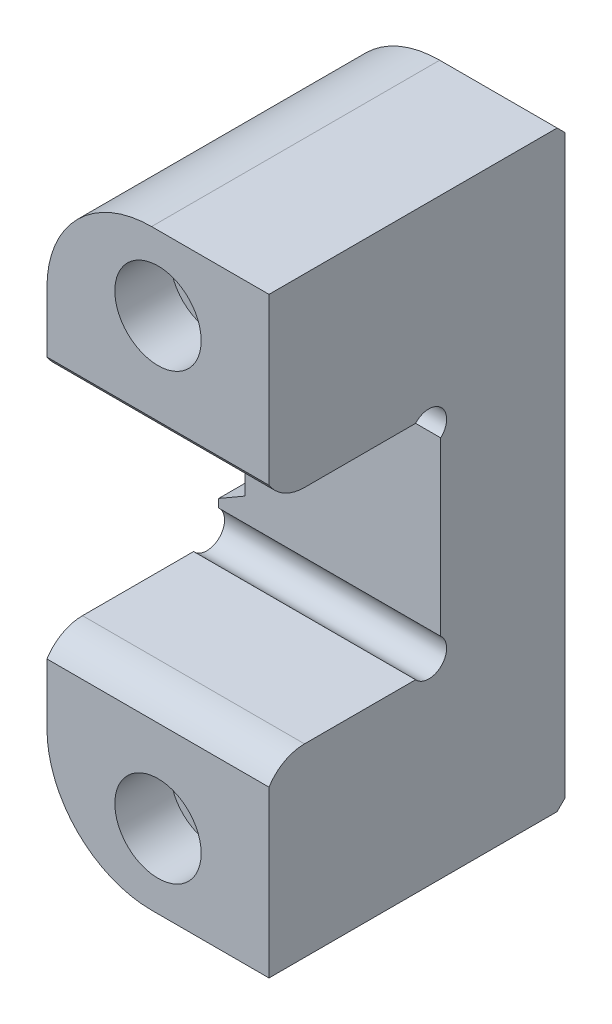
from build123d import *

# Parameters (mm, degrees)
EXTRUDE1_DEPTH             = 14.2875
FILLET1_R                  = 13.462
CUT_EXTRUDE1_DEPTH         = 66.991135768
CUT_EXTRUDE2_DEPTH         = 61.989758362
SKETCH6_R                  = 2.286
CUT_EXTRUDE3_DEPTH         = 61.989758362
F_1_4_20_CBORE_D           = 7.14248
F_1_4_20_CBORE_CBORE_D     = 11.1125
F_1_4_20_CBORE_CBORE_DEPTH = 7.14375
CHAMFER3_SIZE              = 3.81
CHAMFER3_SIZE2             = 1.020886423
CHAMFER1_SIZE              = 1.016


with BuildPart() as part:
    # Sketch1 → Extrude1 (new, symmetric)
    with BuildSketch(Plane(origin=(0, 0, 0), x_dir=(0, 0, -1), z_dir=(1, 0, 0))):
        Polygon((0, 14.2875), (22.098, 14.2875), (22.098, -14.2875), (0, -14.2875), (0, -38.1), (38.1, -38.1), (38.1, 38.1), (0, 38.1), align=None)
    extrude(amount=EXTRUDE1_DEPTH, both=True)

    # Fillet1
    fillet1_edges = [part.edges().sort_by_distance(p)[0] for p in [
        (-14.2875, 38.1, -19.05),
        (-14.2875, -38.1, -19.05),
    ]]
    fillet(fillet1_edges, radius=FILLET1_R)

    # Sketch2 → Cut-Extrude1 (cut, through all)
    with BuildSketch(Plane(origin=(-23.8125, 0, -38.1), x_dir=(1, 0, 0), z_dir=(0, 0, 1))):
        Polygon((8.73125, 10.441543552), (8.73125, -10.441543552), (11.90625, -8.608456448), (11.90625, 8.608456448), align=None)
    extrude(amount=CUT_EXTRUDE1_DEPTH, mode=Mode.SUBTRACT)

    # Sketch5 → Cut-Extrude2 (cut, through all)
    with BuildSketch(Plane(origin=(14.2875, 0, 0), x_dir=(0, 0, -1), z_dir=(1, 0, 0))):
        with BuildLine():
            Line((-1.778, -13.6525), (4.572, -13.6525))
            Line((4.572, -13.6525), (4.572, -14.2875))
            ThreePointArc((4.572, -14.2875), (1.956909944, -14.9651379), (0, -16.8275))
            Line((0, -16.8275), (-1.778, -16.8275))
            Line((-1.778, -16.8275), (-1.778, -13.6525))
        make_face()
        with BuildLine():
            Line((4.572, 13.6525), (4.572, 14.2875))
            ThreePointArc((4.572, 14.2875), (1.956909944, 14.9651379), (0, 16.8275))
            Line((0, 16.8275), (-1.778, 16.8275))
            Line((-1.778, 16.8275), (-1.778, 13.6525))
            Line((-1.778, 13.6525), (4.572, 13.6525))
        make_face()
    extrude(amount=-CUT_EXTRUDE2_DEPTH, mode=Mode.SUBTRACT)

    # Sketch6 → Cut-Extrude3 (cut, through all)
    with BuildSketch(Plane(origin=(14.2875, 0, 0), x_dir=(0, 0, -1), z_dir=(1, 0, 0))):
        with Locations((20.574, 12.7635)):
            Circle(SKETCH6_R)
        with Locations((20.574, -12.7635)):
            Circle(SKETCH6_R)
    extrude(amount=-CUT_EXTRUDE3_DEPTH, mode=Mode.SUBTRACT)

    # 1_4_-20 CBORE (through all)
    with Locations(Plane.XY):
        with Locations((0, 28.575), (0, -28.575)):
            CounterBoreHole(F_1_4_20_CBORE_D / 2, F_1_4_20_CBORE_CBORE_D / 2, F_1_4_20_CBORE_CBORE_DEPTH)

    # Chamfer3
    chamfer3_edges = [part.edges().sort_by_distance(p)[0] for p in [
        (-11.90625, 0, -22.098),
    ]]
    chamfer3_side = [part.faces().sort_by_distance(p)[0] for p in [
        (-11.90625, 0, -30.099),
    ]]
    chamfer(chamfer3_edges, length=CHAMFER3_SIZE, length2=CHAMFER3_SIZE2, reference=chamfer3_side[0])

    # Chamfer1
    chamfer1_edges = [part.edges().sort_by_distance(p)[0] for p in [
        (6.731, 38.1, -38.1),
        (6.731, -38.1, -38.1),
        (-14.2875, -17.310635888, -38.1),
        (-10.344571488, 34.157071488, -38.1),
        (-10.344571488, -34.157071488, -38.1),
        (-14.2875, 17.310635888, -38.1),
    ]]
    chamfer(chamfer1_edges, length=CHAMFER1_SIZE)


solid = part.part
